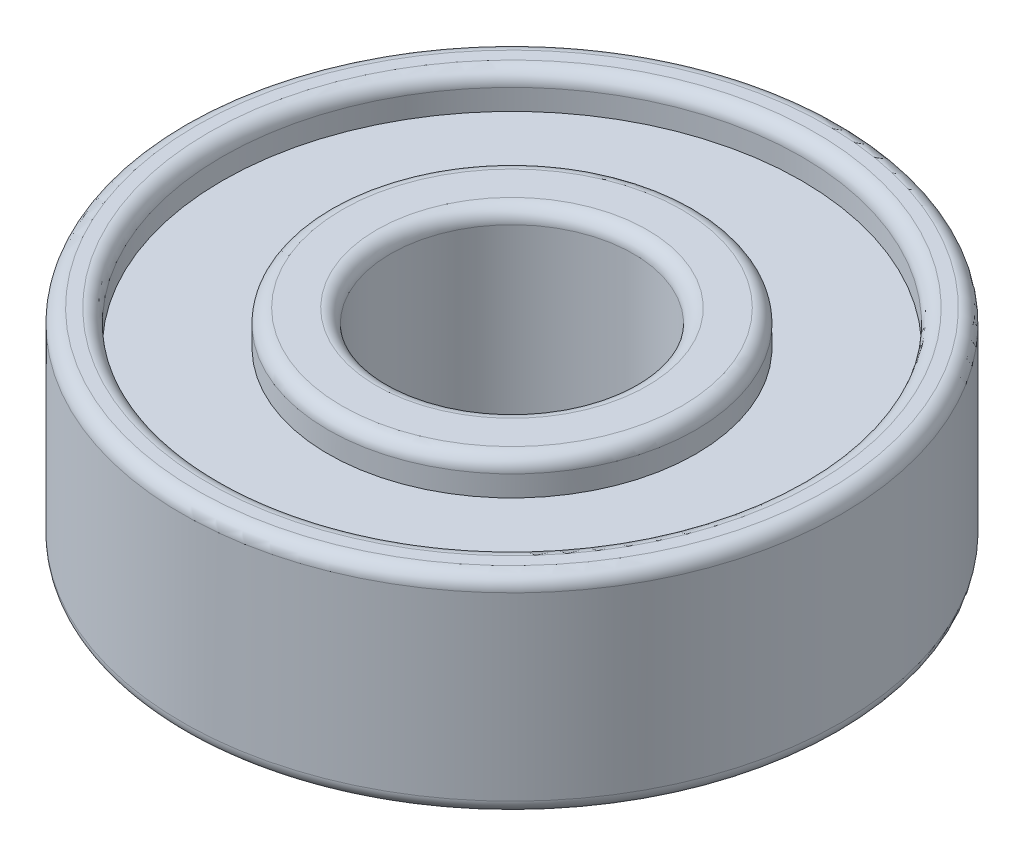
ISO-10303-21;
HEADER;
FILE_DESCRIPTION(('STEP AP214'),'2;1');
FILE_NAME('part.step','',(''),(''),'','','');
FILE_SCHEMA(('AUTOMOTIVE_DESIGN { 1 0 10303 214 1 1 1 1 }'));
ENDSEC;
DATA;
#1=APPLICATION_CONTEXT('core data for automotive mechanical design processes');
#2=APPLICATION_PROTOCOL_DEFINITION('international standard','automotive_design',2000,#1);
#3=PRODUCT_CONTEXT('',#1,'mechanical');
#4=PRODUCT('Part','Part','',(#3));
#5=PRODUCT_RELATED_PRODUCT_CATEGORY('part','',(#4));
#6=PRODUCT_DEFINITION_FORMATION('','',#4);
#7=PRODUCT_DEFINITION_CONTEXT('part definition',#1,'design');
#8=PRODUCT_DEFINITION('design','',#6,#7);
#9=PRODUCT_DEFINITION_SHAPE('','',#8);
#10=(LENGTH_UNIT() NAMED_UNIT(*) SI_UNIT(.MILLI.,.METRE.));
#11=(NAMED_UNIT(*) PLANE_ANGLE_UNIT() SI_UNIT($,.RADIAN.));
#12=(NAMED_UNIT(*) SI_UNIT($,.STERADIAN.) SOLID_ANGLE_UNIT());
#13=UNCERTAINTY_MEASURE_WITH_UNIT(LENGTH_MEASURE(1.E-05),#10,'distance_accuracy_value','');
#14=(GEOMETRIC_REPRESENTATION_CONTEXT(3) GLOBAL_UNCERTAINTY_ASSIGNED_CONTEXT((#13)) GLOBAL_UNIT_ASSIGNED_CONTEXT((#10,
#11,#12)) REPRESENTATION_CONTEXT('',''));
#15=CARTESIAN_POINT('',(0.,0.,0.));
#16=DIRECTION('',(0.,0.,1.));
#17=DIRECTION('',(1.,0.,0.));
#18=AXIS2_PLACEMENT_3D('',#15,#16,#17);
#19=CARTESIAN_POINT('',(0.,0.,0.));
#20=DIRECTION('',(0.,-1.,0.));
#21=DIRECTION('',(1.,0.,0.));
#22=AXIS2_PLACEMENT_3D('',#19,#20,#21);
#23=CYLINDRICAL_SURFACE('',#22,8.35);
#24=CARTESIAN_POINT('',(-1.11022302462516E-13,0.399999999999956,0.));
#25=DIRECTION('',(0.,-1.,0.));
#26=DIRECTION('',(1.,0.,0.));
#27=AXIS2_PLACEMENT_3D('',#24,#25,#26);
#28=CIRCLE('',#27,8.35);
#29=CARTESIAN_POINT('',(8.34999999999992,0.399999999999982,0.));
#30=VERTEX_POINT('',#29);
#31=EDGE_CURVE('E50',#30,#30,#28,.T.);
#32=ORIENTED_EDGE('',*,*,#31,.T.);
#33=EDGE_LOOP('',(#32));
#34=FACE_BOUND('',#33,.T.);
#35=CARTESIAN_POINT('',(0.,0.999999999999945,0.));
#36=DIRECTION('',(0.,-1.,0.));
#37=DIRECTION('',(1.,0.,0.));
#38=AXIS2_PLACEMENT_3D('',#35,#36,#37);
#39=CIRCLE('',#38,8.35);
#40=CARTESIAN_POINT('',(8.35000000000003,0.999999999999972,0.));
#41=VERTEX_POINT('',#40);
#42=EDGE_CURVE('E95',#41,#41,#39,.T.);
#43=ORIENTED_EDGE('',*,*,#42,.F.);
#44=EDGE_LOOP('',(#43));
#45=FACE_BOUND('',#44,.T.);
#46=ADVANCED_FACE('F40',(#34,#45),#23,.F.);
#47=CARTESIAN_POINT('',(5.29999999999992,0.999999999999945,0.));
#48=DIRECTION('',(0.,-1.,0.));
#49=DIRECTION('',(1.,0.,0.));
#50=AXIS2_PLACEMENT_3D('',#47,#48,#49);
#51=PLANE('',#50);
#52=ORIENTED_EDGE('',*,*,#42,.T.);
#53=EDGE_LOOP('',(#52));
#54=FACE_BOUND('',#53,.T.);
#55=CARTESIAN_POINT('',(0.,1.,0.));
#56=DIRECTION('',(0.,-1.,0.));
#57=DIRECTION('',(1.,0.,0.));
#58=AXIS2_PLACEMENT_3D('',#55,#56,#57);
#59=CIRCLE('',#58,5.3);
#60=CARTESIAN_POINT('',(5.30000000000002,1.00000000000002,0.));
#61=VERTEX_POINT('',#60);
#62=EDGE_CURVE('E98',#61,#61,#59,.T.);
#63=ORIENTED_EDGE('',*,*,#62,.F.);
#64=EDGE_LOOP('',(#63));
#65=FACE_BOUND('',#64,.T.);
#66=ADVANCED_FACE('F126',(#54,#65),#51,.T.);
#67=CARTESIAN_POINT('',(0.,0.,0.));
#68=DIRECTION('',(0.,-1.,0.));
#69=DIRECTION('',(1.,0.,0.));
#70=AXIS2_PLACEMENT_3D('',#67,#68,#69);
#71=CYLINDRICAL_SURFACE('',#70,5.3);
#72=CARTESIAN_POINT('',(0.,0.400000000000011,0.));
#73=DIRECTION('',(0.,-1.,0.));
#74=DIRECTION('',(1.,0.,0.));
#75=AXIS2_PLACEMENT_3D('',#72,#73,#74);
#76=CIRCLE('',#75,5.3);
#77=CARTESIAN_POINT('',(5.29999999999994,0.400000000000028,0.));
#78=VERTEX_POINT('',#77);
#79=EDGE_CURVE('E54',#78,#78,#76,.F.);
#80=ORIENTED_EDGE('',*,*,#79,.T.);
#81=EDGE_LOOP('',(#80));
#82=FACE_BOUND('',#81,.T.);
#83=ORIENTED_EDGE('',*,*,#62,.T.);
#84=EDGE_LOOP('',(#83));
#85=FACE_BOUND('',#84,.T.);
#86=ADVANCED_FACE('F131',(#82,#85),#71,.T.);
#87=CARTESIAN_POINT('',(3.49999999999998,0.,0.));
#88=DIRECTION('',(0.,-1.,0.));
#89=DIRECTION('',(1.,0.,0.));
#90=AXIS2_PLACEMENT_3D('',#87,#88,#89);
#91=PLANE('',#90);
#92=CARTESIAN_POINT('',(0.,0.,0.));
#93=DIRECTION('',(0.,-1.,0.));
#94=DIRECTION('',(1.,0.,0.));
#95=AXIS2_PLACEMENT_3D('',#92,#93,#94);
#96=CIRCLE('',#95,3.90000000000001);
#97=CARTESIAN_POINT('',(3.90000000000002,0.,0.));
#98=VERTEX_POINT('',#97);
#99=EDGE_CURVE('E59',#98,#98,#96,.F.);
#100=ORIENTED_EDGE('',*,*,#99,.T.);
#101=EDGE_LOOP('',(#100));
#102=FACE_BOUND('',#101,.T.);
#103=CARTESIAN_POINT('',(0.,0.,0.));
#104=DIRECTION('',(0.,-1.,0.));
#105=DIRECTION('',(1.,0.,0.));
#106=AXIS2_PLACEMENT_3D('',#103,#104,#105);
#107=CIRCLE('',#106,4.9);
#108=CARTESIAN_POINT('',(4.90000000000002,0.,0.));
#109=VERTEX_POINT('',#108);
#110=EDGE_CURVE('E62',#109,#109,#107,.T.);
#111=ORIENTED_EDGE('',*,*,#110,.T.);
#112=EDGE_LOOP('',(#111));
#113=FACE_BOUND('',#112,.T.);
#114=ADVANCED_FACE('F140',(#102,#113),#91,.T.);
#115=CARTESIAN_POINT('',(0.,0.,0.));
#116=DIRECTION('',(0.,-1.,0.));
#117=DIRECTION('',(1.,0.,0.));
#118=AXIS2_PLACEMENT_3D('',#115,#116,#117);
#119=CYLINDRICAL_SURFACE('',#118,3.50000000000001);
#120=CARTESIAN_POINT('',(0.,5.59999999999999,0.));
#121=DIRECTION('',(0.,1.,0.));
#122=DIRECTION('',(-1.,0.,0.));
#123=AXIS2_PLACEMENT_3D('',#120,#121,#122);
#124=CIRCLE('',#123,3.50000000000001);
#125=CARTESIAN_POINT('',(-3.50000000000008,5.59999999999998,0.));
#126=VERTEX_POINT('',#125);
#127=EDGE_CURVE('E80',#126,#126,#124,.T.);
#128=ORIENTED_EDGE('',*,*,#127,.T.);
#129=EDGE_LOOP('',(#128));
#130=FACE_BOUND('',#129,.T.);
#131=CARTESIAN_POINT('',(0.,0.400000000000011,0.));
#132=DIRECTION('',(0.,-1.,0.));
#133=DIRECTION('',(1.,0.,0.));
#134=AXIS2_PLACEMENT_3D('',#131,#132,#133);
#135=CIRCLE('',#134,3.50000000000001);
#136=CARTESIAN_POINT('',(3.49999999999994,0.400000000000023,0.));
#137=VERTEX_POINT('',#136);
#138=EDGE_CURVE('E83',#137,#137,#135,.T.);
#139=ORIENTED_EDGE('',*,*,#138,.T.);
#140=EDGE_LOOP('',(#139));
#141=FACE_BOUND('',#140,.T.);
#142=ADVANCED_FACE('F146',(#130,#141),#119,.F.);
#143=CARTESIAN_POINT('',(5.30000000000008,5.99999999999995,0.));
#144=DIRECTION('',(0.,1.,0.));
#145=DIRECTION('',(-1.,0.,0.));
#146=AXIS2_PLACEMENT_3D('',#143,#144,#145);
#147=PLANE('',#146);
#148=CARTESIAN_POINT('',(0.,5.99999999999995,0.));
#149=DIRECTION('',(0.,1.,0.));
#150=DIRECTION('',(-1.,0.,0.));
#151=AXIS2_PLACEMENT_3D('',#148,#149,#150);
#152=CIRCLE('',#151,4.90000000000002);
#153=CARTESIAN_POINT('',(-4.90000000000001,5.99999999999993,0.));
#154=VERTEX_POINT('',#153);
#155=EDGE_CURVE('E86',#154,#154,#152,.T.);
#156=ORIENTED_EDGE('',*,*,#155,.T.);
#157=EDGE_LOOP('',(#156));
#158=FACE_BOUND('',#157,.T.);
#159=CARTESIAN_POINT('',(0.,5.99999999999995,0.));
#160=DIRECTION('',(0.,1.,0.));
#161=DIRECTION('',(-1.,0.,0.));
#162=AXIS2_PLACEMENT_3D('',#159,#160,#161);
#163=CIRCLE('',#162,3.90000000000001);
#164=CARTESIAN_POINT('',(-3.9,5.99999999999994,0.));
#165=VERTEX_POINT('',#164);
#166=EDGE_CURVE('E89',#165,#165,#163,.F.);
#167=ORIENTED_EDGE('',*,*,#166,.T.);
#168=EDGE_LOOP('',(#167));
#169=FACE_BOUND('',#168,.T.);
#170=ADVANCED_FACE('F122',(#158,#169),#147,.T.);
#171=CARTESIAN_POINT('',(0.,0.,0.));
#172=DIRECTION('',(0.,-1.,0.));
#173=DIRECTION('',(1.,0.,0.));
#174=AXIS2_PLACEMENT_3D('',#171,#172,#173);
#175=CYLINDRICAL_SURFACE('',#174,5.30000000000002);
#176=CARTESIAN_POINT('',(0.,5.59999999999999,0.));
#177=DIRECTION('',(0.,1.,0.));
#178=DIRECTION('',(-1.,0.,0.));
#179=AXIS2_PLACEMENT_3D('',#176,#177,#178);
#180=CIRCLE('',#179,5.30000000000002);
#181=CARTESIAN_POINT('',(-5.30000000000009,5.59999999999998,0.));
#182=VERTEX_POINT('',#181);
#183=EDGE_CURVE('E92',#182,#182,#180,.F.);
#184=ORIENTED_EDGE('',*,*,#183,.T.);
#185=EDGE_LOOP('',(#184));
#186=FACE_BOUND('',#185,.T.);
#187=CARTESIAN_POINT('',(0.,4.99999999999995,0.));
#188=DIRECTION('',(0.,-1.,0.));
#189=DIRECTION('',(1.,0.,0.));
#190=AXIS2_PLACEMENT_3D('',#187,#188,#189);
#191=CIRCLE('',#190,5.30000000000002);
#192=CARTESIAN_POINT('',(5.30000000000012,4.99999999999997,0.));
#193=VERTEX_POINT('',#192);
#194=EDGE_CURVE('E101',#193,#193,#191,.T.);
#195=ORIENTED_EDGE('',*,*,#194,.F.);
#196=EDGE_LOOP('',(#195));
#197=FACE_BOUND('',#196,.T.);
#198=ADVANCED_FACE('F112',(#186,#197),#175,.T.);
#199=CARTESIAN_POINT('',(8.35000000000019,4.99999999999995,0.));
#200=DIRECTION('',(0.,1.,0.));
#201=DIRECTION('',(-1.,0.,0.));
#202=AXIS2_PLACEMENT_3D('',#199,#200,#201);
#203=PLANE('',#202);
#204=ORIENTED_EDGE('',*,*,#194,.T.);
#205=EDGE_LOOP('',(#204));
#206=FACE_BOUND('',#205,.T.);
#207=CARTESIAN_POINT('',(0.,4.99999999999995,0.));
#208=DIRECTION('',(0.,-1.,0.));
#209=DIRECTION('',(1.,0.,0.));
#210=AXIS2_PLACEMENT_3D('',#207,#208,#209);
#211=CIRCLE('',#210,8.35000000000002);
#212=CARTESIAN_POINT('',(8.35000000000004,4.99999999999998,0.));
#213=VERTEX_POINT('',#212);
#214=EDGE_CURVE('E104',#213,#213,#211,.T.);
#215=ORIENTED_EDGE('',*,*,#214,.F.);
#216=EDGE_LOOP('',(#215));
#217=FACE_BOUND('',#216,.T.);
#218=ADVANCED_FACE('F110',(#206,#217),#203,.T.);
#219=CARTESIAN_POINT('',(0.,0.,0.));
#220=DIRECTION('',(0.,-1.,0.));
#221=DIRECTION('',(1.,0.,0.));
#222=AXIS2_PLACEMENT_3D('',#219,#220,#221);
#223=CYLINDRICAL_SURFACE('',#222,8.35000000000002);
#224=CARTESIAN_POINT('',(0.,5.59999999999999,0.));
#225=DIRECTION('',(0.,1.,0.));
#226=DIRECTION('',(-1.,0.,0.));
#227=AXIS2_PLACEMENT_3D('',#224,#225,#226);
#228=CIRCLE('',#227,8.35000000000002);
#229=CARTESIAN_POINT('',(-8.3500000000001,5.59999999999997,0.));
#230=VERTEX_POINT('',#229);
#231=EDGE_CURVE('E65',#230,#230,#228,.T.);
#232=ORIENTED_EDGE('',*,*,#231,.T.);
#233=EDGE_LOOP('',(#232));
#234=FACE_BOUND('',#233,.T.);
#235=ORIENTED_EDGE('',*,*,#214,.T.);
#236=EDGE_LOOP('',(#235));
#237=FACE_BOUND('',#236,.T.);
#238=ADVANCED_FACE('F108',(#234,#237),#223,.F.);
#239=CARTESIAN_POINT('',(9.50000000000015,6.00000000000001,0.));
#240=DIRECTION('',(0.,1.,0.));
#241=DIRECTION('',(-1.,0.,0.));
#242=AXIS2_PLACEMENT_3D('',#239,#240,#241);
#243=PLANE('',#242);
#244=CARTESIAN_POINT('',(0.,5.99999999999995,0.));
#245=DIRECTION('',(0.,1.,0.));
#246=DIRECTION('',(-1.,0.,0.));
#247=AXIS2_PLACEMENT_3D('',#244,#245,#246);
#248=CIRCLE('',#247,9.10000000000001);
#249=CARTESIAN_POINT('',(-9.10000000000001,5.99999999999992,0.));
#250=VERTEX_POINT('',#249);
#251=EDGE_CURVE('E68',#250,#250,#248,.T.);
#252=ORIENTED_EDGE('',*,*,#251,.T.);
#253=EDGE_LOOP('',(#252));
#254=FACE_BOUND('',#253,.T.);
#255=CARTESIAN_POINT('',(0.,5.99999999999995,0.));
#256=DIRECTION('',(0.,1.,0.));
#257=DIRECTION('',(-1.,0.,0.));
#258=AXIS2_PLACEMENT_3D('',#255,#256,#257);
#259=CIRCLE('',#258,8.75000000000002);
#260=CARTESIAN_POINT('',(-8.75000000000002,5.99999999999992,0.));
#261=VERTEX_POINT('',#260);
#262=EDGE_CURVE('E71',#261,#261,#259,.F.);
#263=ORIENTED_EDGE('',*,*,#262,.T.);
#264=EDGE_LOOP('',(#263));
#265=FACE_BOUND('',#264,.T.);
#266=ADVANCED_FACE('F119',(#254,#265),#243,.T.);
#267=CARTESIAN_POINT('',(0.,0.,0.));
#268=DIRECTION('',(0.,-1.,0.));
#269=DIRECTION('',(1.,0.,0.));
#270=AXIS2_PLACEMENT_3D('',#267,#268,#269);
#271=CYLINDRICAL_SURFACE('',#270,9.50000000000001);
#272=CARTESIAN_POINT('',(0.,5.59999999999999,0.));
#273=DIRECTION('',(0.,1.,0.));
#274=DIRECTION('',(-1.,0.,0.));
#275=AXIS2_PLACEMENT_3D('',#272,#273,#274);
#276=CIRCLE('',#275,9.50000000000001);
#277=CARTESIAN_POINT('',(-9.5000000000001,5.59999999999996,0.));
#278=VERTEX_POINT('',#277);
#279=EDGE_CURVE('E74',#278,#278,#276,.F.);
#280=ORIENTED_EDGE('',*,*,#279,.T.);
#281=EDGE_LOOP('',(#280));
#282=FACE_BOUND('',#281,.T.);
#283=CARTESIAN_POINT('',(-1.11022302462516E-13,0.399999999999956,0.));
#284=DIRECTION('',(0.,-1.,0.));
#285=DIRECTION('',(1.,0.,0.));
#286=AXIS2_PLACEMENT_3D('',#283,#284,#285);
#287=CIRCLE('',#286,9.50000000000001);
#288=CARTESIAN_POINT('',(9.49999999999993,0.399999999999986,0.));
#289=VERTEX_POINT('',#288);
#290=EDGE_CURVE('E77',#289,#289,#287,.F.);
#291=ORIENTED_EDGE('',*,*,#290,.T.);
#292=EDGE_LOOP('',(#291));
#293=FACE_BOUND('',#292,.T.);
#294=ADVANCED_FACE('F182',(#282,#293),#271,.T.);
#295=CARTESIAN_POINT('',(8.35000000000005,0.,-1.11022302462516E-13));
#296=DIRECTION('',(0.,-1.,0.));
#297=DIRECTION('',(1.,0.,0.));
#298=AXIS2_PLACEMENT_3D('',#295,#296,#297);
#299=PLANE('',#298);
#300=CARTESIAN_POINT('',(0.,0.,0.));
#301=DIRECTION('',(0.,-1.,0.));
#302=DIRECTION('',(1.,0.,0.));
#303=AXIS2_PLACEMENT_3D('',#300,#301,#302);
#304=CIRCLE('',#303,8.75);
#305=CARTESIAN_POINT('',(8.75000000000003,0.,0.));
#306=VERTEX_POINT('',#305);
#307=EDGE_CURVE('E10',#306,#306,#304,.F.);
#308=ORIENTED_EDGE('',*,*,#307,.T.);
#309=EDGE_LOOP('',(#308));
#310=FACE_BOUND('',#309,.T.);
#311=CARTESIAN_POINT('',(0.,0.,0.));
#312=DIRECTION('',(0.,-1.,0.));
#313=DIRECTION('',(1.,0.,0.));
#314=AXIS2_PLACEMENT_3D('',#311,#312,#313);
#315=CIRCLE('',#314,9.10000000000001);
#316=CARTESIAN_POINT('',(9.10000000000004,0.,0.));
#317=VERTEX_POINT('',#316);
#318=EDGE_CURVE('E46',#317,#317,#315,.T.);
#319=ORIENTED_EDGE('',*,*,#318,.T.);
#320=EDGE_LOOP('',(#319));
#321=FACE_BOUND('',#320,.T.);
#322=ADVANCED_FACE('F174',(#310,#321),#299,.T.);
#323=CARTESIAN_POINT('',(0.,5.59999999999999,0.));
#324=DIRECTION('',(0.,1.,0.));
#325=DIRECTION('',(-1.,0.,0.));
#326=AXIS2_PLACEMENT_3D('',#323,#324,#325);
#327=TOROIDAL_SURFACE('',#326,4.90000000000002,0.4);
#328=ORIENTED_EDGE('',*,*,#155,.F.);
#329=EDGE_LOOP('',(#328));
#330=FACE_BOUND('',#329,.T.);
#331=ORIENTED_EDGE('',*,*,#183,.F.);
#332=EDGE_LOOP('',(#331));
#333=FACE_BOUND('',#332,.T.);
#334=ADVANCED_FACE('F164',(#330,#333),#327,.T.);
#335=CARTESIAN_POINT('',(0.,5.59999999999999,0.));
#336=DIRECTION('',(0.,1.,0.));
#337=DIRECTION('',(-1.,0.,0.));
#338=AXIS2_PLACEMENT_3D('',#335,#336,#337);
#339=TOROIDAL_SURFACE('',#338,3.90000000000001,0.4);
#340=ORIENTED_EDGE('',*,*,#127,.F.);
#341=EDGE_LOOP('',(#340));
#342=FACE_BOUND('',#341,.T.);
#343=ORIENTED_EDGE('',*,*,#166,.F.);
#344=EDGE_LOOP('',(#343));
#345=FACE_BOUND('',#344,.T.);
#346=ADVANCED_FACE('F161',(#342,#345),#339,.T.);
#347=CARTESIAN_POINT('',(0.,5.59999999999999,0.));
#348=DIRECTION('',(0.,1.,0.));
#349=DIRECTION('',(-1.,0.,0.));
#350=AXIS2_PLACEMENT_3D('',#347,#348,#349);
#351=TOROIDAL_SURFACE('',#350,9.10000000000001,0.4);
#352=ORIENTED_EDGE('',*,*,#251,.F.);
#353=EDGE_LOOP('',(#352));
#354=FACE_BOUND('',#353,.T.);
#355=ORIENTED_EDGE('',*,*,#279,.F.);
#356=EDGE_LOOP('',(#355));
#357=FACE_BOUND('',#356,.T.);
#358=ADVANCED_FACE('F163',(#354,#357),#351,.T.);
#359=CARTESIAN_POINT('',(0.,5.59999999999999,0.));
#360=DIRECTION('',(0.,1.,0.));
#361=DIRECTION('',(-1.,0.,0.));
#362=AXIS2_PLACEMENT_3D('',#359,#360,#361);
#363=TOROIDAL_SURFACE('',#362,8.75000000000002,0.4);
#364=ORIENTED_EDGE('',*,*,#231,.F.);
#365=EDGE_LOOP('',(#364));
#366=FACE_BOUND('',#365,.T.);
#367=ORIENTED_EDGE('',*,*,#262,.F.);
#368=EDGE_LOOP('',(#367));
#369=FACE_BOUND('',#368,.T.);
#370=ADVANCED_FACE('F171',(#366,#369),#363,.T.);
#371=CARTESIAN_POINT('',(0.,0.400000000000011,0.));
#372=DIRECTION('',(0.,-1.,0.));
#373=DIRECTION('',(1.,0.,0.));
#374=AXIS2_PLACEMENT_3D('',#371,#372,#373);
#375=TOROIDAL_SURFACE('',#374,3.90000000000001,0.4);
#376=ORIENTED_EDGE('',*,*,#99,.F.);
#377=EDGE_LOOP('',(#376));
#378=FACE_BOUND('',#377,.T.);
#379=ORIENTED_EDGE('',*,*,#138,.F.);
#380=EDGE_LOOP('',(#379));
#381=FACE_BOUND('',#380,.T.);
#382=ADVANCED_FACE('F195',(#378,#381),#375,.T.);
#383=CARTESIAN_POINT('',(0.,0.400000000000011,0.));
#384=DIRECTION('',(0.,-1.,0.));
#385=DIRECTION('',(1.,0.,0.));
#386=AXIS2_PLACEMENT_3D('',#383,#384,#385);
#387=TOROIDAL_SURFACE('',#386,4.9,0.4);
#388=ORIENTED_EDGE('',*,*,#79,.F.);
#389=EDGE_LOOP('',(#388));
#390=FACE_BOUND('',#389,.T.);
#391=ORIENTED_EDGE('',*,*,#110,.F.);
#392=EDGE_LOOP('',(#391));
#393=FACE_BOUND('',#392,.T.);
#394=ADVANCED_FACE('F200',(#390,#393),#387,.T.);
#395=CARTESIAN_POINT('',(-1.11022302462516E-13,0.399999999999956,0.));
#396=DIRECTION('',(0.,-1.,0.));
#397=DIRECTION('',(1.,0.,0.));
#398=AXIS2_PLACEMENT_3D('',#395,#396,#397);
#399=TOROIDAL_SURFACE('',#398,8.75,0.4);
#400=ORIENTED_EDGE('',*,*,#307,.F.);
#401=EDGE_LOOP('',(#400));
#402=FACE_BOUND('',#401,.T.);
#403=ORIENTED_EDGE('',*,*,#31,.F.);
#404=EDGE_LOOP('',(#403));
#405=FACE_BOUND('',#404,.T.);
#406=ADVANCED_FACE('F207',(#402,#405),#399,.T.);
#407=CARTESIAN_POINT('',(-1.11022302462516E-13,0.399999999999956,0.));
#408=DIRECTION('',(0.,-1.,0.));
#409=DIRECTION('',(1.,0.,0.));
#410=AXIS2_PLACEMENT_3D('',#407,#408,#409);
#411=TOROIDAL_SURFACE('',#410,9.10000000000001,0.4);
#412=ORIENTED_EDGE('',*,*,#290,.F.);
#413=EDGE_LOOP('',(#412));
#414=FACE_BOUND('',#413,.T.);
#415=ORIENTED_EDGE('',*,*,#318,.F.);
#416=EDGE_LOOP('',(#415));
#417=FACE_BOUND('',#416,.T.);
#418=ADVANCED_FACE('F211',(#414,#417),#411,.T.);
#419=CLOSED_SHELL('',(#46,#66,#86,#114,#142,#170,#198,#218,#238,#266,#294,#322,#334,#346,#358,
#370,#382,#394,#406,#418));
#420=MANIFOLD_SOLID_BREP('B2',#419);
#421=ADVANCED_BREP_SHAPE_REPRESENTATION('',(#18,#420),#14);
#422=SHAPE_DEFINITION_REPRESENTATION(#9,#421);
ENDSEC;
END-ISO-10303-21;
